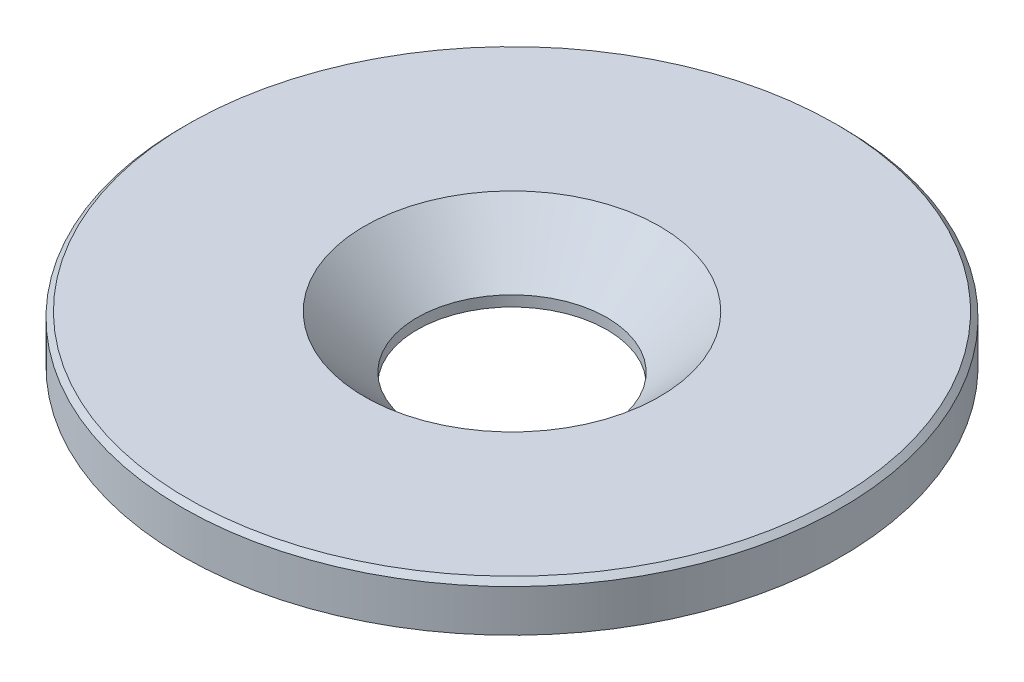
ISO-10303-21;
HEADER;
FILE_DESCRIPTION(('STEP AP214'),'2;1');
FILE_NAME('part.step','',(''),(''),'','','');
FILE_SCHEMA(('AUTOMOTIVE_DESIGN { 1 0 10303 214 1 1 1 1 }'));
ENDSEC;
DATA;
#1=APPLICATION_CONTEXT('core data for automotive mechanical design processes');
#2=APPLICATION_PROTOCOL_DEFINITION('international standard','automotive_design',2000,#1);
#3=PRODUCT_CONTEXT('',#1,'mechanical');
#4=PRODUCT('Part','Part','',(#3));
#5=PRODUCT_RELATED_PRODUCT_CATEGORY('part','',(#4));
#6=PRODUCT_DEFINITION_FORMATION('','',#4);
#7=PRODUCT_DEFINITION_CONTEXT('part definition',#1,'design');
#8=PRODUCT_DEFINITION('design','',#6,#7);
#9=PRODUCT_DEFINITION_SHAPE('','',#8);
#10=(LENGTH_UNIT() NAMED_UNIT(*) SI_UNIT(.MILLI.,.METRE.));
#11=(NAMED_UNIT(*) PLANE_ANGLE_UNIT() SI_UNIT($,.RADIAN.));
#12=(NAMED_UNIT(*) SI_UNIT($,.STERADIAN.) SOLID_ANGLE_UNIT());
#13=UNCERTAINTY_MEASURE_WITH_UNIT(LENGTH_MEASURE(1.E-05),#10,'distance_accuracy_value','');
#14=(GEOMETRIC_REPRESENTATION_CONTEXT(3) GLOBAL_UNCERTAINTY_ASSIGNED_CONTEXT((#13)) GLOBAL_UNIT_ASSIGNED_CONTEXT((#10,
#11,#12)) REPRESENTATION_CONTEXT('',''));
#15=CARTESIAN_POINT('',(0.,0.,0.));
#16=DIRECTION('',(0.,0.,1.));
#17=DIRECTION('',(1.,0.,0.));
#18=AXIS2_PLACEMENT_3D('',#15,#16,#17);
#19=CARTESIAN_POINT('',(0.,0.,0.));
#20=DIRECTION('',(0.,-1.,0.));
#21=DIRECTION('',(0.,0.,-1.));
#22=AXIS2_PLACEMENT_3D('',#19,#20,#21);
#23=CYLINDRICAL_SURFACE('',#22,18.);
#24=CARTESIAN_POINT('',(0.,2.,0.));
#25=DIRECTION('',(0.,-1.,0.));
#26=DIRECTION('',(0.,0.,-1.));
#27=AXIS2_PLACEMENT_3D('',#24,#25,#26);
#28=CIRCLE('',#27,18.);
#29=CARTESIAN_POINT('',(0.,2.,-18.));
#30=VERTEX_POINT('',#29);
#31=EDGE_CURVE('E34',#30,#30,#28,.T.);
#32=ORIENTED_EDGE('',*,*,#31,.F.);
#33=EDGE_LOOP('',(#32));
#34=FACE_BOUND('',#33,.T.);
#35=CARTESIAN_POINT('',(0.,0.,0.));
#36=DIRECTION('',(0.,-1.,0.));
#37=DIRECTION('',(0.,0.,-1.));
#38=AXIS2_PLACEMENT_3D('',#35,#36,#37);
#39=CIRCLE('',#38,18.);
#40=CARTESIAN_POINT('',(0.,0.,-18.));
#41=VERTEX_POINT('',#40);
#42=EDGE_CURVE('E46',#41,#41,#39,.T.);
#43=ORIENTED_EDGE('',*,*,#42,.T.);
#44=EDGE_LOOP('',(#43));
#45=FACE_BOUND('',#44,.T.);
#46=ADVANCED_FACE('F14',(#34,#45),#23,.F.);
#47=CARTESIAN_POINT('',(0.,2.,0.));
#48=DIRECTION('',(0.,1.,0.));
#49=DIRECTION('',(0.,0.,1.));
#50=AXIS2_PLACEMENT_3D('',#47,#48,#49);
#51=CONICAL_SURFACE('',#50,18.,0.78539816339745);
#52=CARTESIAN_POINT('',(0.,12.,0.));
#53=DIRECTION('',(0.,-1.,0.));
#54=DIRECTION('',(0.,0.,-1.));
#55=AXIS2_PLACEMENT_3D('',#52,#53,#54);
#56=CIRCLE('',#55,28.);
#57=CARTESIAN_POINT('',(0.,12.,-28.));
#58=VERTEX_POINT('',#57);
#59=EDGE_CURVE('E37',#58,#58,#56,.T.);
#60=ORIENTED_EDGE('',*,*,#59,.F.);
#61=EDGE_LOOP('',(#60));
#62=FACE_BOUND('',#61,.T.);
#63=ORIENTED_EDGE('',*,*,#31,.T.);
#64=EDGE_LOOP('',(#63));
#65=FACE_BOUND('',#64,.T.);
#66=ADVANCED_FACE('F68',(#62,#65),#51,.F.);
#67=CARTESIAN_POINT('',(-28.,12.,0.));
#68=DIRECTION('',(0.,-1.,0.));
#69=DIRECTION('',(0.,0.,-1.));
#70=AXIS2_PLACEMENT_3D('',#67,#68,#69);
#71=PLANE('',#70);
#72=CARTESIAN_POINT('',(0.,12.,0.));
#73=DIRECTION('',(0.,-1.,0.));
#74=DIRECTION('',(0.,0.,-1.));
#75=AXIS2_PLACEMENT_3D('',#72,#73,#74);
#76=CIRCLE('',#75,61.5);
#77=CARTESIAN_POINT('',(0.,12.,-61.5));
#78=VERTEX_POINT('',#77);
#79=EDGE_CURVE('E9',#78,#78,#76,.F.);
#80=ORIENTED_EDGE('',*,*,#79,.T.);
#81=EDGE_LOOP('',(#80));
#82=FACE_BOUND('',#81,.T.);
#83=ORIENTED_EDGE('',*,*,#59,.T.);
#84=EDGE_LOOP('',(#83));
#85=FACE_BOUND('',#84,.T.);
#86=ADVANCED_FACE('F75',(#82,#85),#71,.F.);
#87=CARTESIAN_POINT('',(0.,0.,0.));
#88=DIRECTION('',(0.,-1.,0.));
#89=DIRECTION('',(0.,0.,-1.));
#90=AXIS2_PLACEMENT_3D('',#87,#88,#89);
#91=CYLINDRICAL_SURFACE('',#90,62.5);
#92=CARTESIAN_POINT('',(0.,11.,0.));
#93=DIRECTION('',(0.,-1.,0.));
#94=DIRECTION('',(0.,0.,-1.));
#95=AXIS2_PLACEMENT_3D('',#92,#93,#94);
#96=CIRCLE('',#95,62.5);
#97=CARTESIAN_POINT('',(0.,11.,-62.5));
#98=VERTEX_POINT('',#97);
#99=EDGE_CURVE('E21',#98,#98,#96,.T.);
#100=ORIENTED_EDGE('',*,*,#99,.T.);
#101=EDGE_LOOP('',(#100));
#102=FACE_BOUND('',#101,.T.);
#103=CARTESIAN_POINT('',(0.,3.,0.));
#104=DIRECTION('',(0.,-1.,0.));
#105=DIRECTION('',(0.,0.,-1.));
#106=AXIS2_PLACEMENT_3D('',#103,#104,#105);
#107=CIRCLE('',#106,62.5);
#108=CARTESIAN_POINT('',(0.,3.,-62.5));
#109=VERTEX_POINT('',#108);
#110=EDGE_CURVE('E40',#109,#109,#107,.T.);
#111=ORIENTED_EDGE('',*,*,#110,.F.);
#112=EDGE_LOOP('',(#111));
#113=FACE_BOUND('',#112,.T.);
#114=ADVANCED_FACE('F82',(#102,#113),#91,.T.);
#115=CARTESIAN_POINT('',(-45.,3.,0.));
#116=DIRECTION('',(0.,1.,0.));
#117=DIRECTION('',(0.,0.,1.));
#118=AXIS2_PLACEMENT_3D('',#115,#116,#117);
#119=PLANE('',#118);
#120=CARTESIAN_POINT('',(0.,3.,0.));
#121=DIRECTION('',(0.,-1.,0.));
#122=DIRECTION('',(0.,0.,-1.));
#123=AXIS2_PLACEMENT_3D('',#120,#121,#122);
#124=CIRCLE('',#123,45.);
#125=CARTESIAN_POINT('',(0.,3.,-45.));
#126=VERTEX_POINT('',#125);
#127=EDGE_CURVE('E43',#126,#126,#124,.T.);
#128=ORIENTED_EDGE('',*,*,#127,.F.);
#129=EDGE_LOOP('',(#128));
#130=FACE_BOUND('',#129,.T.);
#131=ORIENTED_EDGE('',*,*,#110,.T.);
#132=EDGE_LOOP('',(#131));
#133=FACE_BOUND('',#132,.T.);
#134=ADVANCED_FACE('F64',(#130,#133),#119,.F.);
#135=CARTESIAN_POINT('',(0.,0.,0.));
#136=DIRECTION('',(0.,-1.,0.));
#137=DIRECTION('',(0.,0.,-1.));
#138=AXIS2_PLACEMENT_3D('',#135,#136,#137);
#139=CYLINDRICAL_SURFACE('',#138,45.);
#140=CARTESIAN_POINT('',(0.,0.999999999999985,0.));
#141=DIRECTION('',(0.,1.,0.));
#142=DIRECTION('',(0.,0.,1.));
#143=AXIS2_PLACEMENT_3D('',#140,#141,#142);
#144=CIRCLE('',#143,45.);
#145=CARTESIAN_POINT('',(0.,0.999999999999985,45.));
#146=VERTEX_POINT('',#145);
#147=EDGE_CURVE('E25',#146,#146,#144,.T.);
#148=ORIENTED_EDGE('',*,*,#147,.T.);
#149=EDGE_LOOP('',(#148));
#150=FACE_BOUND('',#149,.T.);
#151=ORIENTED_EDGE('',*,*,#127,.T.);
#152=EDGE_LOOP('',(#151));
#153=FACE_BOUND('',#152,.T.);
#154=ADVANCED_FACE('F54',(#150,#153),#139,.T.);
#155=CARTESIAN_POINT('',(-18.,0.,0.));
#156=DIRECTION('',(0.,1.,0.));
#157=DIRECTION('',(0.,0.,1.));
#158=AXIS2_PLACEMENT_3D('',#155,#156,#157);
#159=PLANE('',#158);
#160=CARTESIAN_POINT('',(0.,0.,0.));
#161=DIRECTION('',(0.,1.,0.));
#162=DIRECTION('',(0.,0.,1.));
#163=AXIS2_PLACEMENT_3D('',#160,#161,#162);
#164=CIRCLE('',#163,44.);
#165=CARTESIAN_POINT('',(0.,0.,44.));
#166=VERTEX_POINT('',#165);
#167=EDGE_CURVE('E29',#166,#166,#164,.F.);
#168=ORIENTED_EDGE('',*,*,#167,.T.);
#169=EDGE_LOOP('',(#168));
#170=FACE_BOUND('',#169,.T.);
#171=ORIENTED_EDGE('',*,*,#42,.F.);
#172=EDGE_LOOP('',(#171));
#173=FACE_BOUND('',#172,.T.);
#174=ADVANCED_FACE('F51',(#170,#173),#159,.F.);
#175=CARTESIAN_POINT('',(0.,0.,0.));
#176=DIRECTION('',(0.,1.,0.));
#177=DIRECTION('',(0.,0.,1.));
#178=AXIS2_PLACEMENT_3D('',#175,#176,#177);
#179=CONICAL_SURFACE('',#178,44.,0.785398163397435);
#180=ORIENTED_EDGE('',*,*,#147,.F.);
#181=EDGE_LOOP('',(#180));
#182=FACE_BOUND('',#181,.T.);
#183=ORIENTED_EDGE('',*,*,#167,.F.);
#184=EDGE_LOOP('',(#183));
#185=FACE_BOUND('',#184,.T.);
#186=ADVANCED_FACE('F53',(#182,#185),#179,.T.);
#187=CARTESIAN_POINT('',(0.,11.,0.));
#188=DIRECTION('',(0.,-1.,0.));
#189=DIRECTION('',(0.,0.,-1.));
#190=AXIS2_PLACEMENT_3D('',#187,#188,#189);
#191=CONICAL_SURFACE('',#190,62.5,0.785398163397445);
#192=ORIENTED_EDGE('',*,*,#79,.F.);
#193=EDGE_LOOP('',(#192));
#194=FACE_BOUND('',#193,.T.);
#195=ORIENTED_EDGE('',*,*,#99,.F.);
#196=EDGE_LOOP('',(#195));
#197=FACE_BOUND('',#196,.T.);
#198=ADVANCED_FACE('F16',(#194,#197),#191,.T.);
#199=CLOSED_SHELL('',(#46,#66,#86,#114,#134,#154,#174,#186,#198));
#200=MANIFOLD_SOLID_BREP('B1',#199);
#201=ADVANCED_BREP_SHAPE_REPRESENTATION('',(#18,#200),#14);
#202=SHAPE_DEFINITION_REPRESENTATION(#9,#201);
ENDSEC;
END-ISO-10303-21;
